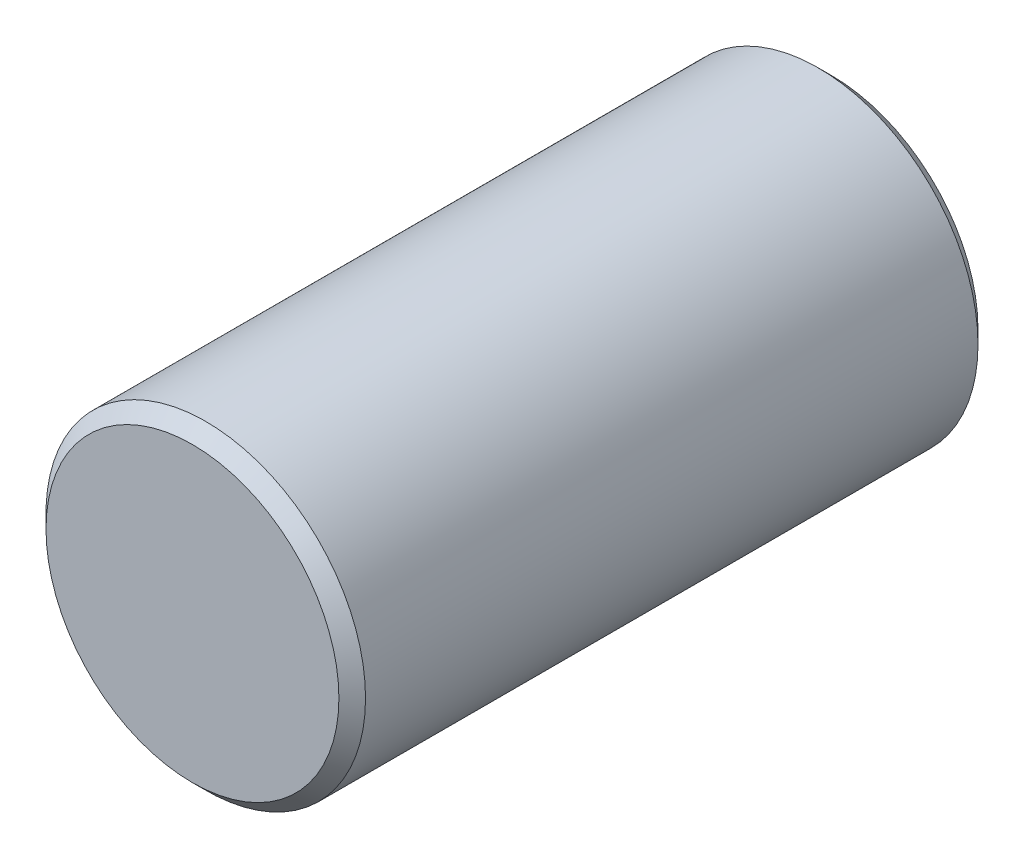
from build123d import *


with BuildPart() as part:
    # Sketch1 → Revolve1 (revolve)
    with BuildSketch(Plane(origin=(0, 0, 0), x_dir=(0, 0, -1), z_dir=(1, 0, 0)), mode=Mode.PRIVATE) as revolve1_sk:
        Polygon((0, 0), (12, 0), (12, 2.749986), (11.749986, 3), (0.250014, 3), (0, 2.749986), align=None)
    revolve(revolve1_sk.sketch.rotate(Axis((0, 0, -10.674691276), (0, 0, -1)), 90), axis=Axis((0, 0, -10.674691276), (0, 0, -1)))


solid = part.part
